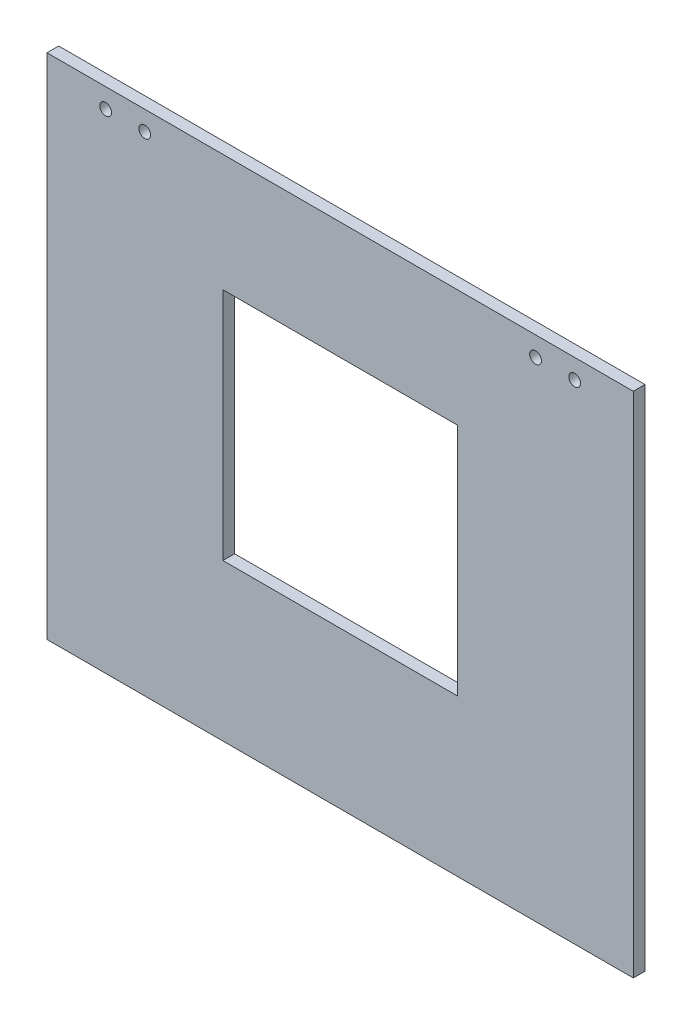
from build123d import *

# Parameters (mm, degrees)
ESQUISSE1_W      = 150
ESQUISSE1_H      = 130
ESQUISSE1_R      = 1.5
ESQUISSE1_W_2    = 60
ESQUISSE1_H_2    = 60
EXTRUSION1_DEPTH = 3


with BuildPart() as part:
    # Esquisse1 → Extrusion1 (new body)
    with BuildSketch(Plane.XY):
        with Locations((75, 65)):
            Rectangle(ESQUISSE1_W, ESQUISSE1_H)
        with Locations((15, 125)):
            Circle(ESQUISSE1_R, mode=Mode.SUBTRACT)
        with Locations(Location((135, 125, 0), (0, 0, 180))):
            Circle(ESQUISSE1_R, mode=Mode.SUBTRACT)
        with Locations((25, 125)):
            Circle(ESQUISSE1_R, mode=Mode.SUBTRACT)
        with Locations(Location((125, 125, 0), (0, 0, 180))):
            Circle(ESQUISSE1_R, mode=Mode.SUBTRACT)
        with Locations((75, 70)):
            Rectangle(ESQUISSE1_W_2, ESQUISSE1_H_2, mode=Mode.SUBTRACT)
    extrude(amount=EXTRUSION1_DEPTH)


solid = part.part
